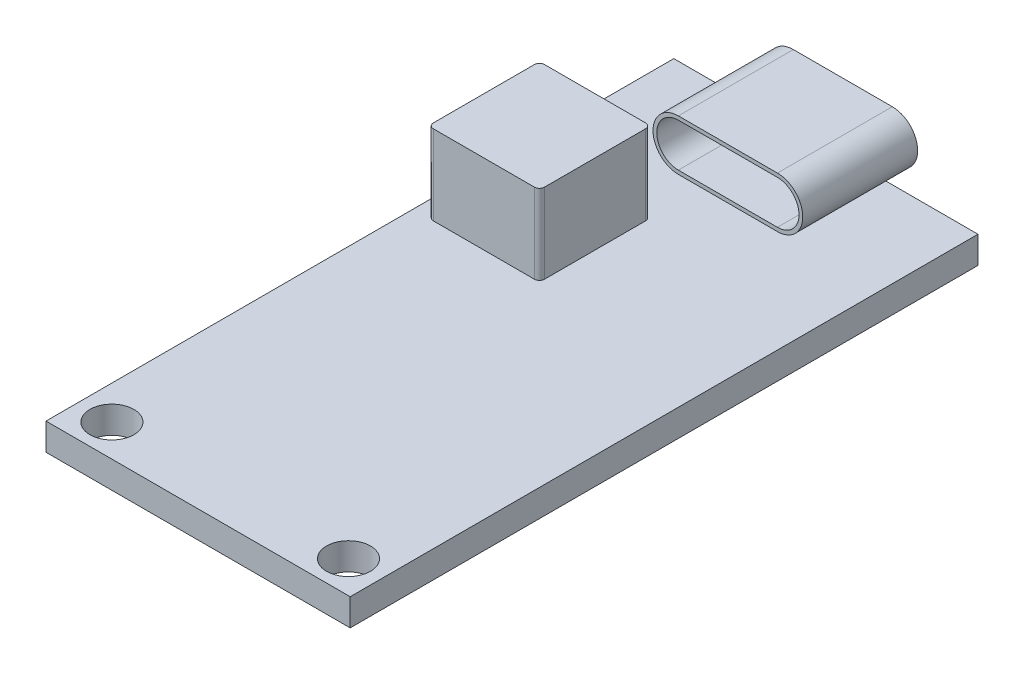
from build123d import *

# Parameters (mm, degrees)
SKETCH1_W                = 18
SKETCH1_H                = 37.15
BOSS_EXTRUDE1_DEPTH      = 1.6
SKETCH2_R                = 1.3
CUT_EXTRUDE1_DEPTH       = 21.702430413
BOSS_EXTRUDE2_DEPTH      = 1
BOSS_EXTRUDE2_DEPTH_BACK = 5.8
SKETCH4_W                = 6.58
SKETCH4_H                = 6.58
BOSS_EXTRUDE3_DEPTH      = 4.72
FILLET1_R                = 0.3


with BuildPart() as part:
    # Sketch1 → Boss-Extrude1 (new body)
    with BuildSketch(Plane(origin=(0, 0, 0), x_dir=(1, 0, 0), z_dir=(0, 1, 0))):
        Rectangle(SKETCH1_W, SKETCH1_H)
    extrude(amount=BOSS_EXTRUDE1_DEPTH)

    # Sketch2 → Cut-Extrude1 (cut, through all)
    with BuildSketch(Plane(origin=(0, 1.6, 0), x_dir=(1, 0, 0), z_dir=(0, 1, 0))):
        with Locations(Location((-7, -16.675, 0), (0, 0, 270))):
            Circle(SKETCH2_R)
        with Locations(Location((7, -16.675, 0), (0, 0, 270))):
            Circle(SKETCH2_R)
    extrude(amount=-CUT_EXTRUDE1_DEPTH, mode=Mode.SUBTRACT)

    # Sketch3 → Boss-Extrude2 (add, two sides: drawn at the far end of the back side and taken through both)
    with BuildSketch(Plane(origin=(0, 0, -18.575), x_dir=(-1, 0, 0), z_dir=(0, 0, -1)).offset(-BOSS_EXTRUDE2_DEPTH_BACK)):
        with BuildLine():
            Line((2.93, 1.6), (-2.93, 1.6))
            ThreePointArc((-2.93, 1.6), (-4.43, 3.1), (-2.93, 4.6))
            Line((-2.93, 4.6), (2.93, 4.6))
            ThreePointArc((2.93, 4.6), (4.43, 3.1), (2.93, 1.6))
        make_face()
        with BuildLine():
            Line((2.93, 1.82), (-2.93, 1.82))
            ThreePointArc((-2.93, 1.82), (-4.21, 3.1), (-2.93, 4.38))
            Line((-2.93, 4.38), (2.93, 4.38))
            ThreePointArc((2.93, 4.38), (4.21, 3.1), (2.93, 1.82))
        make_face(mode=Mode.SUBTRACT)
    extrude(amount=BOSS_EXTRUDE2_DEPTH + BOSS_EXTRUDE2_DEPTH_BACK)

    # Sketch4 → Boss-Extrude3 (add)
    with BuildSketch(Plane(origin=(0, 1.6, 0), x_dir=(1, 0, 0), z_dir=(0, 1, 0))):
        with Locations((-4.81, 6.435)):
            Rectangle(SKETCH4_W, SKETCH4_H)
    extrude(amount=BOSS_EXTRUDE3_DEPTH)

    # Fillet1
    fillet1_edges = [part.edges().sort_by_distance(p)[0] for p in [
        (-1.52, 3.96, -3.145),
        (-1.52, 3.96, -9.725),
        (-8.1, 3.96, -9.725),
        (-8.1, 3.96, -3.145),
    ]]
    fillet(fillet1_edges, radius=FILLET1_R)


solid = part.part
